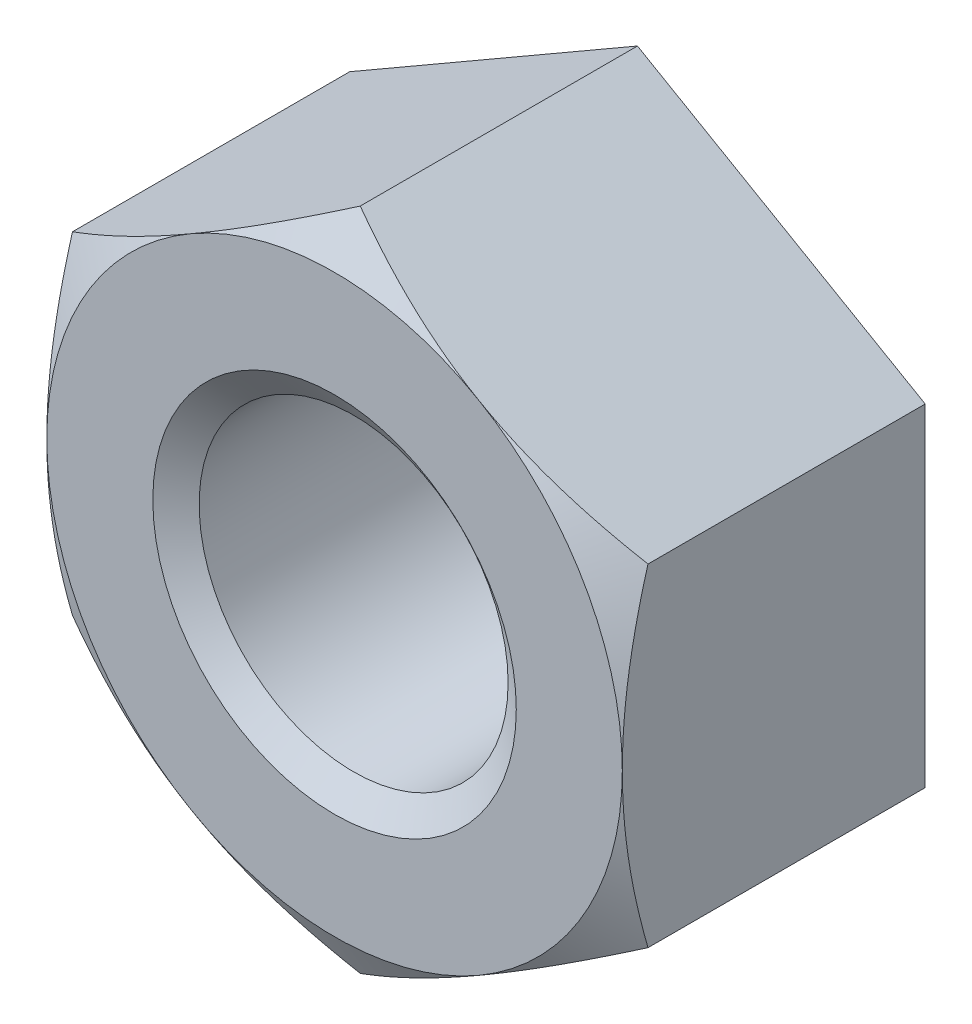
ISO-10303-21;
HEADER;
FILE_DESCRIPTION(('STEP AP214'),'2;1');
FILE_NAME('part.step','',(''),(''),'','','');
FILE_SCHEMA(('AUTOMOTIVE_DESIGN { 1 0 10303 214 1 1 1 1 }'));
ENDSEC;
DATA;
#1=APPLICATION_CONTEXT('core data for automotive mechanical design processes');
#2=APPLICATION_PROTOCOL_DEFINITION('international standard','automotive_design',2000,#1);
#3=PRODUCT_CONTEXT('',#1,'mechanical');
#4=PRODUCT('Part','Part','',(#3));
#5=PRODUCT_RELATED_PRODUCT_CATEGORY('part','',(#4));
#6=PRODUCT_DEFINITION_FORMATION('','',#4);
#7=PRODUCT_DEFINITION_CONTEXT('part definition',#1,'design');
#8=PRODUCT_DEFINITION('design','',#6,#7);
#9=PRODUCT_DEFINITION_SHAPE('','',#8);
#10=(LENGTH_UNIT() NAMED_UNIT(*) SI_UNIT(.MILLI.,.METRE.));
#11=(NAMED_UNIT(*) PLANE_ANGLE_UNIT() SI_UNIT($,.RADIAN.));
#12=(NAMED_UNIT(*) SI_UNIT($,.STERADIAN.) SOLID_ANGLE_UNIT());
#13=UNCERTAINTY_MEASURE_WITH_UNIT(LENGTH_MEASURE(1.E-05),#10,'distance_accuracy_value','');
#14=(GEOMETRIC_REPRESENTATION_CONTEXT(3) GLOBAL_UNCERTAINTY_ASSIGNED_CONTEXT((#13)) GLOBAL_UNIT_ASSIGNED_CONTEXT((#10,
#11,#12)) REPRESENTATION_CONTEXT('',''));
#15=CARTESIAN_POINT('',(0.,0.,0.));
#16=DIRECTION('',(0.,0.,1.));
#17=DIRECTION('',(1.,0.,0.));
#18=AXIS2_PLACEMENT_3D('',#15,#16,#17);
#19=CARTESIAN_POINT('',(0.,0.,-10.));
#20=DIRECTION('',(0.,0.,1.));
#21=DIRECTION('',(1.,0.,0.));
#22=AXIS2_PLACEMENT_3D('',#19,#20,#21);
#23=CYLINDRICAL_SURFACE('',#22,5.1);
#24=CARTESIAN_POINT('',(0.,0.,-0.630186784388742));
#25=DIRECTION('',(0.,0.,1.));
#26=DIRECTION('',(1.,0.,0.));
#27=AXIS2_PLACEMENT_3D('',#24,#25,#26);
#28=CIRCLE('',#27,5.1);
#29=CARTESIAN_POINT('',(5.1,0.,-0.630186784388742));
#30=VERTEX_POINT('',#29);
#31=EDGE_CURVE('E227',#30,#30,#28,.F.);
#32=ORIENTED_EDGE('',*,*,#31,.F.);
#33=EDGE_LOOP('',(#32));
#34=FACE_BOUND('',#33,.T.);
#35=CARTESIAN_POINT('',(0.,0.,-9.34441321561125));
#36=DIRECTION('',(0.,0.,-1.));
#37=DIRECTION('',(-1.,0.,0.));
#38=AXIS2_PLACEMENT_3D('',#35,#36,#37);
#39=CIRCLE('',#38,5.1);
#40=CARTESIAN_POINT('',(-5.1,0.,-9.34441321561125));
#41=VERTEX_POINT('',#40);
#42=EDGE_CURVE('E43',#41,#41,#39,.F.);
#43=ORIENTED_EDGE('',*,*,#42,.F.);
#44=EDGE_LOOP('',(#43));
#45=FACE_BOUND('',#44,.T.);
#46=ADVANCED_FACE('F38',(#34,#45),#23,.F.);
#47=CARTESIAN_POINT('',(0.,10.9696551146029,-10.));
#48=DIRECTION('',(0.,0.,-1.));
#49=DIRECTION('',(-1.,0.,0.));
#50=AXIS2_PLACEMENT_3D('',#47,#48,#49);
#51=PLANE('',#50);
#52=DIRECTION('',(-0.866025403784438,-0.500000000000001,0.));
#53=VECTOR('',#52,1.);
#54=CARTESIAN_POINT('',(0.,10.9696551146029,-10.));
#55=LINE('',#54,#53);
#56=CARTESIAN_POINT('',(0.,10.9696551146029,-10.));
#57=VERTEX_POINT('',#56);
#58=CARTESIAN_POINT('',(-9.5,5.48482755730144,-10.));
#59=VERTEX_POINT('',#58);
#60=EDGE_CURVE('E194',#57,#59,#55,.T.);
#61=ORIENTED_EDGE('',*,*,#60,.F.);
#62=DIRECTION('',(-0.866025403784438,0.500000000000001,0.));
#63=VECTOR('',#62,1.);
#64=CARTESIAN_POINT('',(9.5,5.48482755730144,-10.));
#65=LINE('',#64,#63);
#66=CARTESIAN_POINT('',(9.5,5.48482755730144,-10.));
#67=VERTEX_POINT('',#66);
#68=EDGE_CURVE('E244',#67,#57,#65,.T.);
#69=ORIENTED_EDGE('',*,*,#68,.F.);
#70=DIRECTION('',(0.,-1.,0.));
#71=VECTOR('',#70,1.);
#72=CARTESIAN_POINT('',(9.5,5.48482755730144,-10.));
#73=LINE('',#72,#71);
#74=CARTESIAN_POINT('',(9.5,-5.48482755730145,-10.));
#75=VERTEX_POINT('',#74);
#76=EDGE_CURVE('E258',#67,#75,#73,.T.);
#77=ORIENTED_EDGE('',*,*,#76,.T.);
#78=DIRECTION('',(0.866025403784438,0.500000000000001,0.));
#79=VECTOR('',#78,1.);
#80=CARTESIAN_POINT('',(0.,-10.9696551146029,-10.));
#81=LINE('',#80,#79);
#82=CARTESIAN_POINT('',(0.,-10.9696551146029,-10.));
#83=VERTEX_POINT('',#82);
#84=EDGE_CURVE('E260',#83,#75,#81,.T.);
#85=ORIENTED_EDGE('',*,*,#84,.F.);
#86=DIRECTION('',(0.866025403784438,-0.500000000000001,0.));
#87=VECTOR('',#86,1.);
#88=CARTESIAN_POINT('',(-9.5,-5.48482755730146,-10.));
#89=LINE('',#88,#87);
#90=CARTESIAN_POINT('',(-9.5,-5.48482755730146,-10.));
#91=VERTEX_POINT('',#90);
#92=EDGE_CURVE('E263',#91,#83,#89,.T.);
#93=ORIENTED_EDGE('',*,*,#92,.F.);
#94=DIRECTION('',(0.,-1.,0.));
#95=VECTOR('',#94,1.);
#96=CARTESIAN_POINT('',(-9.5,5.48482755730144,-10.));
#97=LINE('',#96,#95);
#98=EDGE_CURVE('E265',#59,#91,#97,.T.);
#99=ORIENTED_EDGE('',*,*,#98,.F.);
#100=EDGE_LOOP('',(#61,#69,#77,#85,#93,#99));
#101=FACE_BOUND('',#100,.T.);
#102=CARTESIAN_POINT('',(0.,0.,-10.));
#103=DIRECTION('',(0.,0.,-1.));
#104=DIRECTION('',(-1.,0.,0.));
#105=AXIS2_PLACEMENT_3D('',#102,#103,#104);
#106=CIRCLE('',#105,6.);
#107=CARTESIAN_POINT('',(-6.,0.,-10.));
#108=VERTEX_POINT('',#107);
#109=EDGE_CURVE('E232',#108,#108,#106,.F.);
#110=ORIENTED_EDGE('',*,*,#109,.T.);
#111=EDGE_LOOP('',(#110));
#112=FACE_BOUND('',#111,.T.);
#113=ADVANCED_FACE('F218',(#101,#112),#51,.T.);
#114=CARTESIAN_POINT('',(0.,10.9696551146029,0.));
#115=DIRECTION('',(0.,0.,-1.));
#116=DIRECTION('',(-1.,0.,0.));
#117=AXIS2_PLACEMENT_3D('',#114,#115,#116);
#118=PLANE('',#117);
#119=CARTESIAN_POINT('',(0.,0.,0.));
#120=DIRECTION('',(0.,0.,-1.));
#121=DIRECTION('',(-1.,0.,0.));
#122=AXIS2_PLACEMENT_3D('',#119,#120,#121);
#123=CIRCLE('',#122,9.5);
#124=CARTESIAN_POINT('',(-9.5,0.,0.));
#125=VERTEX_POINT('',#124);
#126=CARTESIAN_POINT('',(-4.75000000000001,8.22724133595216,0.));
#127=VERTEX_POINT('',#126);
#128=EDGE_CURVE('E11',#125,#127,#123,.T.);
#129=ORIENTED_EDGE('',*,*,#128,.F.);
#130=CARTESIAN_POINT('',(-4.75000000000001,-8.22724133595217,0.));
#131=VERTEX_POINT('',#130);
#132=EDGE_CURVE('E50',#131,#125,#123,.T.);
#133=ORIENTED_EDGE('',*,*,#132,.F.);
#134=CARTESIAN_POINT('',(4.75000000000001,-8.22724133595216,0.));
#135=VERTEX_POINT('',#134);
#136=EDGE_CURVE('E134',#135,#131,#123,.T.);
#137=ORIENTED_EDGE('',*,*,#136,.F.);
#138=CARTESIAN_POINT('',(9.5,0.,0.));
#139=VERTEX_POINT('',#138);
#140=EDGE_CURVE('E271',#139,#135,#123,.T.);
#141=ORIENTED_EDGE('',*,*,#140,.F.);
#142=CARTESIAN_POINT('',(0.,0.,0.));
#143=DIRECTION('',(0.,0.,1.));
#144=DIRECTION('',(1.,0.,0.));
#145=AXIS2_PLACEMENT_3D('',#142,#143,#144);
#146=CIRCLE('',#145,9.5);
#147=CARTESIAN_POINT('',(4.75000000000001,8.22724133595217,0.));
#148=VERTEX_POINT('',#147);
#149=EDGE_CURVE('E123',#139,#148,#146,.T.);
#150=ORIENTED_EDGE('',*,*,#149,.T.);
#151=EDGE_CURVE('E48',#127,#148,#123,.T.);
#152=ORIENTED_EDGE('',*,*,#151,.F.);
#153=EDGE_LOOP('',(#129,#133,#137,#141,#150,#152));
#154=FACE_BOUND('',#153,.T.);
#155=CARTESIAN_POINT('',(0.,0.,0.));
#156=DIRECTION('',(0.,0.,1.));
#157=DIRECTION('',(1.,0.,0.));
#158=AXIS2_PLACEMENT_3D('',#155,#156,#157);
#159=CIRCLE('',#158,6.);
#160=CARTESIAN_POINT('',(6.,0.,0.));
#161=VERTEX_POINT('',#160);
#162=EDGE_CURVE('E231',#161,#161,#159,.T.);
#163=ORIENTED_EDGE('',*,*,#162,.F.);
#164=EDGE_LOOP('',(#163));
#165=FACE_BOUND('',#164,.T.);
#166=ADVANCED_FACE('F136',(#154,#165),#118,.F.);
#167=CARTESIAN_POINT('',(0.,10.9696551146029,-10.));
#168=DIRECTION('',(-0.500000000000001,0.866025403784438,0.));
#169=DIRECTION('',(-0.866025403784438,-0.500000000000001,0.));
#170=AXIS2_PLACEMENT_3D('',#167,#168,#169);
#171=PLANE('',#170);
#172=DIRECTION('',(0.,0.,1.));
#173=VECTOR('',#172,1.);
#174=CARTESIAN_POINT('',(-9.5,5.48482755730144,-10.));
#175=LINE('',#174,#173);
#176=CARTESIAN_POINT('',(-9.5,5.48482755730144,-0.848505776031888));
#177=VERTEX_POINT('',#176);
#178=EDGE_CURVE('E242',#59,#177,#175,.T.);
#179=ORIENTED_EDGE('',*,*,#178,.T.);
#180=CARTESIAN_POINT('',(-9.5002,5.4847120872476,-0.848572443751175));
#181=CARTESIAN_POINT('',(-9.2913692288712,5.60528058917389,-0.778973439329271));
#182=CARTESIAN_POINT('',(-9.08175982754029,5.72629863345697,-0.712533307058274));
#183=CARTESIAN_POINT('',(-8.66086011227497,5.96930519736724,-0.586847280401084));
#184=CARTESIAN_POINT('',(-8.44956926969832,6.09129402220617,-0.527603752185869));
#185=CARTESIAN_POINT('',(-7.81229220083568,6.45922610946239,-0.361814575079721));
#186=CARTESIAN_POINT('',(-7.38379023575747,6.70662183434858,-0.267514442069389));
#187=CARTESIAN_POINT('',(-6.74255666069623,7.07683821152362,-0.156938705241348));
#188=CARTESIAN_POINT('',(-6.53174078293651,7.19855281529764,-0.125439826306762));
#189=CARTESIAN_POINT('',(-6.10913296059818,7.44254555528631,-0.0726182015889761));
#190=CARTESIAN_POINT('',(-5.89734099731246,7.56482370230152,-0.0512956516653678));
#191=CARTESIAN_POINT('',(-5.47340378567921,7.80958396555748,-0.019373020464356));
#192=CARTESIAN_POINT('',(-5.26125925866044,7.93206566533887,-0.00876019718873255));
#193=CARTESIAN_POINT('',(-4.83677424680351,8.17714220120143,0.0015174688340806));
#194=CARTESIAN_POINT('',(-4.62443376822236,8.29973703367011,0.00118264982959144));
#195=CARTESIAN_POINT('',(-4.22745800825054,8.5289310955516,-0.00967336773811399));
#196=CARTESIAN_POINT('',(-4.04279470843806,8.63554650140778,-0.0188702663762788));
#197=CARTESIAN_POINT('',(-3.67389999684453,8.84852796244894,-0.045365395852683));
#198=CARTESIAN_POINT('',(-3.48966861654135,8.95489399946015,-0.0626641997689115));
#199=CARTESIAN_POINT('',(-2.937688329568,9.27357996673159,-0.126304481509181));
#200=CARTESIAN_POINT('',(-2.57091646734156,9.4853358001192,-0.184381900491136));
#201=CARTESIAN_POINT('',(-1.83348217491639,9.91109368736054,-0.329576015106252));
#202=CARTESIAN_POINT('',(-1.46291385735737,10.1250414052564,-0.417308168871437));
#203=CARTESIAN_POINT('',(-0.727303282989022,10.5497463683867,-0.616423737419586));
#204=CARTESIAN_POINT('',(-0.362251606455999,10.7605090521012,-0.727760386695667));
#205=CARTESIAN_POINT('',(0.000199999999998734,10.9697705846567,-0.848572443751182));
#206=B_SPLINE_CURVE_WITH_KNOTS('',3,(#180,#181,#182,#183,#184,#185,#186,#187,#188,#189,#190,
#191,#192,#193,#194,#195,#196,#197,#198,#199,#200,#201,#202,#203,#204,#205),.UNSPECIFIED.,.F.,
.F.,(4,2,2,2,2,2,2,2,2,2,2,2,4),(0.,0.752880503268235,1.50600787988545,3.0154687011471,
3.75167336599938,4.48789219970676,5.22323407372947,5.95855322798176,6.59868084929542,
7.23885375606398,8.52010929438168,9.82978009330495,11.1368800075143),.UNSPECIFIED.);
#207=EDGE_CURVE('E118',#177,#127,#206,.T.);
#208=ORIENTED_EDGE('',*,*,#207,.T.);
#209=CARTESIAN_POINT('',(0.,10.9696551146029,-0.848505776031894));
#210=VERTEX_POINT('',#209);
#211=EDGE_CURVE('E57',#127,#210,#206,.T.);
#212=ORIENTED_EDGE('',*,*,#211,.T.);
#213=DIRECTION('',(0.,0.,1.));
#214=VECTOR('',#213,1.);
#215=CARTESIAN_POINT('',(0.,10.9696551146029,-10.));
#216=LINE('',#215,#214);
#217=EDGE_CURVE('E135',#57,#210,#216,.T.);
#218=ORIENTED_EDGE('',*,*,#217,.F.);
#219=ORIENTED_EDGE('',*,*,#60,.T.);
#220=EDGE_LOOP('',(#179,#208,#212,#218,#219));
#221=FACE_BOUND('',#220,.T.);
#222=ADVANCED_FACE('F40',(#221),#171,.T.);
#223=CARTESIAN_POINT('',(9.5,5.48482755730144,-10.));
#224=DIRECTION('',(0.500000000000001,0.866025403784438,0.));
#225=DIRECTION('',(-0.866025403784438,0.500000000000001,0.));
#226=AXIS2_PLACEMENT_3D('',#223,#224,#225);
#227=PLANE('',#226);
#228=ORIENTED_EDGE('',*,*,#217,.T.);
#229=CARTESIAN_POINT('',(-0.000200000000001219,10.9697705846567,-0.848572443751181));
#230=CARTESIAN_POINT('',(0.208630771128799,10.8492020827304,-0.778973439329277));
#231=CARTESIAN_POINT('',(0.418240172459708,10.7281840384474,-0.712533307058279));
#232=CARTESIAN_POINT('',(0.839139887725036,10.4851774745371,-0.586847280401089));
#233=CARTESIAN_POINT('',(1.05043073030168,10.3631886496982,-0.527603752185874));
#234=CARTESIAN_POINT('',(1.68770779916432,9.99525656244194,-0.361814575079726));
#235=CARTESIAN_POINT('',(2.11620976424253,9.74786083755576,-0.267514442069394));
#236=CARTESIAN_POINT('',(2.75744333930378,9.37764446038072,-0.156938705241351));
#237=CARTESIAN_POINT('',(2.96825921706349,9.2559298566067,-0.125439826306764));
#238=CARTESIAN_POINT('',(3.39086703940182,9.01193711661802,-0.0726182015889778));
#239=CARTESIAN_POINT('',(3.60265900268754,8.88965896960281,-0.0512956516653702));
#240=CARTESIAN_POINT('',(4.0265962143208,8.64489870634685,-0.0193730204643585));
#241=CARTESIAN_POINT('',(4.23874074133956,8.52241700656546,-0.0087601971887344));
#242=CARTESIAN_POINT('',(4.66322575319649,8.2773404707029,0.00151746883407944));
#243=CARTESIAN_POINT('',(4.87556623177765,8.15474563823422,0.00118264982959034));
#244=CARTESIAN_POINT('',(5.27254199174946,7.92555157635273,-0.00967336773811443));
#245=CARTESIAN_POINT('',(5.45720529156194,7.81893617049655,-0.0188702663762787));
#246=CARTESIAN_POINT('',(5.82610000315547,7.6059547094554,-0.0453653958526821));
#247=CARTESIAN_POINT('',(6.01033138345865,7.49958867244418,-0.0626641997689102));
#248=CARTESIAN_POINT('',(6.56231167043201,7.18090270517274,-0.126304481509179));
#249=CARTESIAN_POINT('',(6.92908353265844,6.96914687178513,-0.184381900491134));
#250=CARTESIAN_POINT('',(7.66651782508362,6.5433889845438,-0.329576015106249));
#251=CARTESIAN_POINT('',(8.03708614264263,6.32944126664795,-0.417308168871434));
#252=CARTESIAN_POINT('',(8.77269671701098,5.90473630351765,-0.616423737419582));
#253=CARTESIAN_POINT('',(9.137748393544,5.69397361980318,-0.727760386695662));
#254=CARTESIAN_POINT('',(9.5002,5.4847120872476,-0.848572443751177));
#255=B_SPLINE_CURVE_WITH_KNOTS('',3,(#229,#230,#231,#232,#233,#234,#235,#236,#237,#238,#239,
#240,#241,#242,#243,#244,#245,#246,#247,#248,#249,#250,#251,#252,#253,#254),.UNSPECIFIED.,.F.,
.F.,(4,2,2,2,2,2,2,2,2,2,2,2,4),(0.,0.752880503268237,1.50600787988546,3.01546870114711,
3.75167336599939,4.48789219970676,5.22323407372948,5.95855322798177,6.59868084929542,
7.23885375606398,8.52010929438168,9.82978009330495,11.1368800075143),.UNSPECIFIED.);
#256=EDGE_CURVE('E193',#210,#148,#255,.T.);
#257=ORIENTED_EDGE('',*,*,#256,.T.);
#258=CARTESIAN_POINT('',(9.5,5.48482755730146,-0.848505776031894));
#259=VERTEX_POINT('',#258);
#260=EDGE_CURVE('E64',#148,#259,#255,.T.);
#261=ORIENTED_EDGE('',*,*,#260,.T.);
#262=DIRECTION('',(0.,0.,1.));
#263=VECTOR('',#262,1.);
#264=CARTESIAN_POINT('',(9.5,5.48482755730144,-10.));
#265=LINE('',#264,#263);
#266=EDGE_CURVE('E251',#67,#259,#265,.T.);
#267=ORIENTED_EDGE('',*,*,#266,.F.);
#268=ORIENTED_EDGE('',*,*,#68,.T.);
#269=EDGE_LOOP('',(#228,#257,#261,#267,#268));
#270=FACE_BOUND('',#269,.T.);
#271=ADVANCED_FACE('F196',(#270),#227,.T.);
#272=CARTESIAN_POINT('',(9.5,5.48482755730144,-10.));
#273=DIRECTION('',(-1.,0.,0.));
#274=DIRECTION('',(0.,0.,1.));
#275=AXIS2_PLACEMENT_3D('',#272,#273,#274);
#276=PLANE('',#275);
#277=CARTESIAN_POINT('',(9.5,-14.5465709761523,-4.54600370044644));
#278=CARTESIAN_POINT('',(9.5,-14.3380268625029,-4.44519656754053));
#279=CARTESIAN_POINT('',(9.5,-14.129230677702,-4.34491115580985));
#280=CARTESIAN_POINT('',(9.5,-13.7110809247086,-4.14550353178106));
#281=CARTESIAN_POINT('',(9.5,-13.5017273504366,-4.04638133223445));
#282=CARTESIAN_POINT('',(9.5,-12.8726893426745,-3.75091045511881));
#283=CARTESIAN_POINT('',(9.5,-12.4520954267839,-3.55649036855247));
#284=CARTESIAN_POINT('',(9.5,-11.6055942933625,-3.17293577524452));
#285=CARTESIAN_POINT('',(9.5,-11.1796704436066,-2.98383788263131));
#286=CARTESIAN_POINT('',(9.5,-10.3243227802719,-2.61376109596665));
#287=CARTESIAN_POINT('',(9.5,-9.89489915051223,-2.4327817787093));
#288=CARTESIAN_POINT('',(9.5,-9.02653674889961,-2.07895754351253));
#289=CARTESIAN_POINT('',(9.5,-8.58754588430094,-1.90623976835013));
#290=CARTESIAN_POINT('',(9.5,-7.70438743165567,-1.57433108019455));
#291=CARTESIAN_POINT('',(9.5,-7.26021927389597,-1.41514167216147));
#292=CARTESIAN_POINT('',(9.5,-6.36690631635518,-1.11456802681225));
#293=CARTESIAN_POINT('',(9.5,-5.9177743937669,-0.973145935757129));
#294=CARTESIAN_POINT('',(9.5,-5.01314169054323,-0.712697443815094));
#295=CARTESIAN_POINT('',(9.5,-4.55764297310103,-0.5936639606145));
#296=CARTESIAN_POINT('',(9.5,-3.6398894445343,-0.383780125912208));
#297=CARTESIAN_POINT('',(9.5,-3.17763286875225,-0.292937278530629));
#298=CARTESIAN_POINT('',(9.5,-2.48018032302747,-0.182364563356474));
#299=CARTESIAN_POINT('',(9.5,-2.24698958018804,-0.14978651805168));
#300=CARTESIAN_POINT('',(9.5,-1.77951479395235,-0.0938352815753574));
#301=CARTESIAN_POINT('',(9.5,-1.54523086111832,-0.0704611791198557));
#302=CARTESIAN_POINT('',(9.5,-1.07737258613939,-0.0335468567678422));
#303=CARTESIAN_POINT('',(9.5,-0.843803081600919,-0.0199455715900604));
#304=CARTESIAN_POINT('',(9.5,-0.376297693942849,-0.00264879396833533));
#305=CARTESIAN_POINT('',(9.5,-0.142361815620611,0.0010468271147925));
#306=CARTESIAN_POINT('',(9.5,0.325389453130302,-0.00155578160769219));
#307=CARTESIAN_POINT('',(9.5,0.559204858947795,-0.00785120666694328));
#308=CARTESIAN_POINT('',(9.5,1.02636653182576,-0.030279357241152));
#309=CARTESIAN_POINT('',(9.5,1.25971277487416,-0.0464125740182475));
#310=CARTESIAN_POINT('',(9.5,1.82527222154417,-0.0971001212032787));
#311=CARTESIAN_POINT('',(9.5,2.15705089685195,-0.136583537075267));
#312=CARTESIAN_POINT('',(9.5,2.81806585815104,-0.233246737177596));
#313=CARTESIAN_POINT('',(9.5,3.14730142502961,-0.290431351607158));
#314=CARTESIAN_POINT('',(9.5,3.80295855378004,-0.420468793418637));
#315=CARTESIAN_POINT('',(9.5,4.12937714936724,-0.4933364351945));
#316=CARTESIAN_POINT('',(9.5,4.77885595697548,-0.652516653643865));
#317=CARTESIAN_POINT('',(9.5,5.10191648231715,-0.738827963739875));
#318=CARTESIAN_POINT('',(9.5,5.75263605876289,-0.925086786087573));
#319=CARTESIAN_POINT('',(9.5,6.08021372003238,-1.02531669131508));
#320=CARTESIAN_POINT('',(9.5,6.73190653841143,-1.23567979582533));
#321=CARTESIAN_POINT('',(9.5,7.05602391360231,-1.34580616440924));
#322=CARTESIAN_POINT('',(9.5,7.69949559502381,-1.5736874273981));
#323=CARTESIAN_POINT('',(9.5,8.01886644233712,-1.69139589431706));
#324=CARTESIAN_POINT('',(9.5,8.65513026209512,-1.93372164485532));
#325=CARTESIAN_POINT('',(9.5,8.97202217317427,-2.05834172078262));
#326=CARTESIAN_POINT('',(9.5,9.28776285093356,-2.18573389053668));
#327=B_SPLINE_CURVE_WITH_KNOTS('',3,(#277,#278,#279,#280,#281,#282,#283,#284,#285,#286,#287,
#288,#289,#290,#291,#292,#293,#294,#295,#296,#297,#298,#299,#300,#301,#302,#303,#304,#305,#306,
#307,#308,#309,#310,#311,#312,#313,#314,#315,#316,#317,#318,#319,#320,#321,#322,#323,#324,#325,
#326),.UNSPECIFIED.,.F.,.F.,(4,2,2,2,2,2,2,2,2,2,2,2,2,2,2,2,2,2,2,2,2,2,2,2,4),(0.,
0.694890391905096,1.38978839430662,2.7798104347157,4.17778700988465,5.57569062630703,
6.99075616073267,8.40597890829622,9.81813342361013,11.2298404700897,12.6419229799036,
13.3481360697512,14.0542792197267,14.7559707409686,15.4576531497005,16.1591386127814,
16.8606591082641,17.8624602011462,18.8645349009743,19.8675603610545,20.8704913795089,
21.8980064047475,22.9248175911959,23.9458491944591,24.9672963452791),.UNSPECIFIED.);
#328=CARTESIAN_POINT('',(9.50000000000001,-5.48482755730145,-0.848505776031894));
#329=VERTEX_POINT('',#328);
#330=EDGE_CURVE('E178',#329,#139,#327,.T.);
#331=ORIENTED_EDGE('',*,*,#330,.F.);
#332=DIRECTION('',(0.,0.,1.));
#333=VECTOR('',#332,1.);
#334=CARTESIAN_POINT('',(9.5,-5.48482755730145,-10.));
#335=LINE('',#334,#333);
#336=EDGE_CURVE('E248',#75,#329,#335,.T.);
#337=ORIENTED_EDGE('',*,*,#336,.F.);
#338=ORIENTED_EDGE('',*,*,#76,.F.);
#339=ORIENTED_EDGE('',*,*,#266,.T.);
#340=EDGE_CURVE('E187',#139,#259,#327,.T.);
#341=ORIENTED_EDGE('',*,*,#340,.F.);
#342=EDGE_LOOP('',(#331,#337,#338,#339,#341));
#343=FACE_BOUND('',#342,.T.);
#344=ADVANCED_FACE('F200',(#343),#276,.F.);
#345=CARTESIAN_POINT('',(0.,-10.9696551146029,-10.));
#346=DIRECTION('',(0.500000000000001,-0.866025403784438,0.));
#347=DIRECTION('',(0.866025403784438,0.500000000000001,0.));
#348=AXIS2_PLACEMENT_3D('',#345,#346,#347);
#349=PLANE('',#348);
#350=ORIENTED_EDGE('',*,*,#336,.T.);
#351=CARTESIAN_POINT('',(9.5002,-5.48471208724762,-0.84857244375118));
#352=CARTESIAN_POINT('',(9.2913692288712,-5.60528058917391,-0.778973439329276));
#353=CARTESIAN_POINT('',(9.08175982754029,-5.72629863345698,-0.71253330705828));
#354=CARTESIAN_POINT('',(8.66086011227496,-5.96930519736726,-0.58684728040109));
#355=CARTESIAN_POINT('',(8.44956926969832,-6.09129402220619,-0.527603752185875));
#356=CARTESIAN_POINT('',(7.81229220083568,-6.45922610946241,-0.361814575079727));
#357=CARTESIAN_POINT('',(7.38379023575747,-6.70662183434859,-0.267514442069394));
#358=CARTESIAN_POINT('',(6.74255666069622,-7.07683821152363,-0.156938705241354));
#359=CARTESIAN_POINT('',(6.53174078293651,-7.19855281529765,-0.125439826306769));
#360=CARTESIAN_POINT('',(6.10913296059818,-7.44254555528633,-0.0726182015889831));
#361=CARTESIAN_POINT('',(5.89734099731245,-7.56482370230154,-0.0512956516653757));
#362=CARTESIAN_POINT('',(5.4734037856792,-7.8095839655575,-0.0193730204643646));
#363=CARTESIAN_POINT('',(5.26125925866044,-7.93206566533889,-0.00876019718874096));
#364=CARTESIAN_POINT('',(4.83677424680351,-8.17714220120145,0.00151746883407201));
#365=CARTESIAN_POINT('',(4.62443376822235,-8.29973703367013,0.00118264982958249));
#366=CARTESIAN_POINT('',(4.22745800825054,-8.52893109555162,-0.00967336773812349));
#367=CARTESIAN_POINT('',(4.04279470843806,-8.6355465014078,-0.0188702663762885));
#368=CARTESIAN_POINT('',(3.67389999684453,-8.84852796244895,-0.0453653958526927));
#369=CARTESIAN_POINT('',(3.48966861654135,-8.95489399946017,-0.0626641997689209));
#370=CARTESIAN_POINT('',(2.93768832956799,-9.2735799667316,-0.12630448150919));
#371=CARTESIAN_POINT('',(2.57091646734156,-9.48533580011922,-0.184381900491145));
#372=CARTESIAN_POINT('',(1.83348217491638,-9.91109368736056,-0.329576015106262));
#373=CARTESIAN_POINT('',(1.46291385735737,-10.1250414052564,-0.417308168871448));
#374=CARTESIAN_POINT('',(0.72730328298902,-10.5497463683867,-0.616423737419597));
#375=CARTESIAN_POINT('',(0.362251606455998,-10.7605090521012,-0.727760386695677));
#376=CARTESIAN_POINT('',(-0.000199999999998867,-10.9697705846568,-0.848572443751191));
#377=B_SPLINE_CURVE_WITH_KNOTS('',3,(#351,#352,#353,#354,#355,#356,#357,#358,#359,#360,#361,
#362,#363,#364,#365,#366,#367,#368,#369,#370,#371,#372,#373,#374,#375,#376),.UNSPECIFIED.,.F.,
.F.,(4,2,2,2,2,2,2,2,2,2,2,2,4),(0.,0.752880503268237,1.50600787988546,3.01546870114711,
3.75167336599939,4.48789219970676,5.22323407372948,5.95855322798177,6.59868084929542,
7.23885375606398,8.52010929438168,9.82978009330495,11.1368800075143),.UNSPECIFIED.);
#378=EDGE_CURVE('E277',#329,#135,#377,.T.);
#379=ORIENTED_EDGE('',*,*,#378,.T.);
#380=CARTESIAN_POINT('',(0.,-10.9696551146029,-0.848505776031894));
#381=VERTEX_POINT('',#380);
#382=EDGE_CURVE('E172',#135,#381,#377,.T.);
#383=ORIENTED_EDGE('',*,*,#382,.T.);
#384=DIRECTION('',(0.,0.,1.));
#385=VECTOR('',#384,1.);
#386=CARTESIAN_POINT('',(0.,-10.9696551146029,-10.));
#387=LINE('',#386,#385);
#388=EDGE_CURVE('E246',#83,#381,#387,.T.);
#389=ORIENTED_EDGE('',*,*,#388,.F.);
#390=ORIENTED_EDGE('',*,*,#84,.T.);
#391=EDGE_LOOP('',(#350,#379,#383,#389,#390));
#392=FACE_BOUND('',#391,.T.);
#393=ADVANCED_FACE('F204',(#392),#349,.T.);
#394=CARTESIAN_POINT('',(-9.5,-5.48482755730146,-10.));
#395=DIRECTION('',(-0.500000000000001,-0.866025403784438,0.));
#396=DIRECTION('',(0.866025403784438,-0.500000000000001,0.));
#397=AXIS2_PLACEMENT_3D('',#394,#395,#396);
#398=PLANE('',#397);
#399=ORIENTED_EDGE('',*,*,#388,.T.);
#400=CARTESIAN_POINT('',(0.000200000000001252,-10.9697705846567,-0.84857244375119));
#401=CARTESIAN_POINT('',(-0.2086307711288,-10.8492020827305,-0.778973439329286));
#402=CARTESIAN_POINT('',(-0.41824017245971,-10.7281840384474,-0.712533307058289));
#403=CARTESIAN_POINT('',(-0.839139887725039,-10.4851774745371,-0.586847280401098));
#404=CARTESIAN_POINT('',(-1.05043073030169,-10.3631886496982,-0.527603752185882));
#405=CARTESIAN_POINT('',(-1.68770779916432,-9.99525656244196,-0.361814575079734));
#406=CARTESIAN_POINT('',(-2.11620976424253,-9.74786083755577,-0.267514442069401));
#407=CARTESIAN_POINT('',(-2.75744333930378,-9.37764446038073,-0.156938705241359));
#408=CARTESIAN_POINT('',(-2.9682592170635,-9.25592985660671,-0.125439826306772));
#409=CARTESIAN_POINT('',(-3.39086703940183,-9.01193711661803,-0.0726182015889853));
#410=CARTESIAN_POINT('',(-3.60265900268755,-8.88965896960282,-0.0512956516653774));
#411=CARTESIAN_POINT('',(-4.0265962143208,-8.64489870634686,-0.0193730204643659));
#412=CARTESIAN_POINT('',(-4.23874074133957,-8.52241700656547,-0.00876019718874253));
#413=CARTESIAN_POINT('',(-4.6632257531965,-8.27734047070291,0.00151746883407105));
#414=CARTESIAN_POINT('',(-4.87556623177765,-8.15474563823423,0.00118264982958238));
#415=CARTESIAN_POINT('',(-5.27254199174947,-7.92555157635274,-0.00967336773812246));
#416=CARTESIAN_POINT('',(-5.45720529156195,-7.81893617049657,-0.0188702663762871));
#417=CARTESIAN_POINT('',(-5.82610000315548,-7.60595470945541,-0.0453653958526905));
#418=CARTESIAN_POINT('',(-6.01033138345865,-7.4995886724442,-0.0626641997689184));
#419=CARTESIAN_POINT('',(-6.56231167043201,-7.18090270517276,-0.126304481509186));
#420=CARTESIAN_POINT('',(-6.92908353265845,-6.96914687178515,-0.184381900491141));
#421=CARTESIAN_POINT('',(-7.66651782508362,-6.54338898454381,-0.329576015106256));
#422=CARTESIAN_POINT('',(-8.03708614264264,-6.32944126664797,-0.417308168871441));
#423=CARTESIAN_POINT('',(-8.77269671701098,-5.90473630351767,-0.616423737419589));
#424=CARTESIAN_POINT('',(-9.137748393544,-5.6939736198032,-0.727760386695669));
#425=CARTESIAN_POINT('',(-9.5002,-5.48471208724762,-0.848572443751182));
#426=B_SPLINE_CURVE_WITH_KNOTS('',3,(#400,#401,#402,#403,#404,#405,#406,#407,#408,#409,#410,
#411,#412,#413,#414,#415,#416,#417,#418,#419,#420,#421,#422,#423,#424,#425),.UNSPECIFIED.,.F.,
.F.,(4,2,2,2,2,2,2,2,2,2,2,2,4),(0.,0.752880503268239,1.50600787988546,3.01546870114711,
3.75167336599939,4.48789219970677,5.22323407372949,5.95855322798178,6.59868084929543,
7.23885375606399,8.52010929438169,9.82978009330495,11.1368800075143),.UNSPECIFIED.);
#427=EDGE_CURVE('E143',#381,#131,#426,.T.);
#428=ORIENTED_EDGE('',*,*,#427,.T.);
#429=CARTESIAN_POINT('',(-9.5,-5.48482755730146,-0.848505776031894));
#430=VERTEX_POINT('',#429);
#431=EDGE_CURVE('E130',#131,#430,#426,.T.);
#432=ORIENTED_EDGE('',*,*,#431,.T.);
#433=DIRECTION('',(0.,0.,1.));
#434=VECTOR('',#433,1.);
#435=CARTESIAN_POINT('',(-9.5,-5.48482755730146,-10.));
#436=LINE('',#435,#434);
#437=EDGE_CURVE('E142',#91,#430,#436,.T.);
#438=ORIENTED_EDGE('',*,*,#437,.F.);
#439=ORIENTED_EDGE('',*,*,#92,.T.);
#440=EDGE_LOOP('',(#399,#428,#432,#438,#439));
#441=FACE_BOUND('',#440,.T.);
#442=ADVANCED_FACE('F208',(#441),#398,.T.);
#443=CARTESIAN_POINT('',(-9.5,5.48482755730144,-10.));
#444=DIRECTION('',(-1.,0.,0.));
#445=DIRECTION('',(0.,0.,1.));
#446=AXIS2_PLACEMENT_3D('',#443,#444,#445);
#447=PLANE('',#446);
#448=ORIENTED_EDGE('',*,*,#437,.T.);
#449=CARTESIAN_POINT('',(-9.5,-14.5465709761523,-4.54600370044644));
#450=CARTESIAN_POINT('',(-9.5,-14.3380268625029,-4.44519656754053));
#451=CARTESIAN_POINT('',(-9.5,-14.129230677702,-4.34491115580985));
#452=CARTESIAN_POINT('',(-9.5,-13.7110809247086,-4.14550353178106));
#453=CARTESIAN_POINT('',(-9.5,-13.5017273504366,-4.04638133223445));
#454=CARTESIAN_POINT('',(-9.5,-12.8726893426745,-3.75091045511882));
#455=CARTESIAN_POINT('',(-9.5,-12.4520954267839,-3.55649036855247));
#456=CARTESIAN_POINT('',(-9.5,-11.6055942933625,-3.17293577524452));
#457=CARTESIAN_POINT('',(-9.5,-11.1796704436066,-2.98383788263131));
#458=CARTESIAN_POINT('',(-9.5,-10.3243227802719,-2.61376109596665));
#459=CARTESIAN_POINT('',(-9.5,-9.89489915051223,-2.4327817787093));
#460=CARTESIAN_POINT('',(-9.5,-9.02653674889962,-2.07895754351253));
#461=CARTESIAN_POINT('',(-9.5,-8.58754588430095,-1.90623976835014));
#462=CARTESIAN_POINT('',(-9.5,-7.70438743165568,-1.57433108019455));
#463=CARTESIAN_POINT('',(-9.5,-7.26021927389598,-1.41514167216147));
#464=CARTESIAN_POINT('',(-9.5,-6.36690631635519,-1.11456802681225));
#465=CARTESIAN_POINT('',(-9.5,-5.9177743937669,-0.973145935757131));
#466=CARTESIAN_POINT('',(-9.5,-5.01314169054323,-0.712697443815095));
#467=CARTESIAN_POINT('',(-9.5,-4.55764297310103,-0.593663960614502));
#468=CARTESIAN_POINT('',(-9.5,-3.63988944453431,-0.383780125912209));
#469=CARTESIAN_POINT('',(-9.5,-3.17763286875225,-0.292937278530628));
#470=CARTESIAN_POINT('',(-9.5,-2.48018032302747,-0.182364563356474));
#471=CARTESIAN_POINT('',(-9.5,-2.24698958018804,-0.149786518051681));
#472=CARTESIAN_POINT('',(-9.5,-1.77951479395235,-0.0938352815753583));
#473=CARTESIAN_POINT('',(-9.5,-1.54523086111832,-0.070461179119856));
#474=CARTESIAN_POINT('',(-9.5,-1.07737258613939,-0.0335468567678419));
#475=CARTESIAN_POINT('',(-9.5,-0.843803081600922,-0.0199455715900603));
#476=CARTESIAN_POINT('',(-9.5,-0.376297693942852,-0.00264879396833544));
#477=CARTESIAN_POINT('',(-9.5,-0.142361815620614,0.00104682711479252));
#478=CARTESIAN_POINT('',(-9.5,0.325389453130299,-0.00155578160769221));
#479=CARTESIAN_POINT('',(-9.5,0.559204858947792,-0.00785120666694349));
#480=CARTESIAN_POINT('',(-9.5,1.02636653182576,-0.0302793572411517));
#481=CARTESIAN_POINT('',(-9.5,1.25971277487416,-0.0464125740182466));
#482=CARTESIAN_POINT('',(-9.5,1.82527222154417,-0.0971001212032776));
#483=CARTESIAN_POINT('',(-9.5,2.15705089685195,-0.136583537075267));
#484=CARTESIAN_POINT('',(-9.5,2.81806585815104,-0.233246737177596));
#485=CARTESIAN_POINT('',(-9.5,3.14730142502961,-0.290431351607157));
#486=CARTESIAN_POINT('',(-9.5,3.80295855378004,-0.420468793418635));
#487=CARTESIAN_POINT('',(-9.5,4.12937714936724,-0.4933364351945));
#488=CARTESIAN_POINT('',(-9.5,4.77885595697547,-0.652516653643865));
#489=CARTESIAN_POINT('',(-9.5,5.10191648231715,-0.738827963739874));
#490=CARTESIAN_POINT('',(-9.5,5.75263605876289,-0.925086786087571));
#491=CARTESIAN_POINT('',(-9.5,6.08021372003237,-1.02531669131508));
#492=CARTESIAN_POINT('',(-9.5,6.73190653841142,-1.23567979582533));
#493=CARTESIAN_POINT('',(-9.5,7.05602391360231,-1.34580616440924));
#494=CARTESIAN_POINT('',(-9.5,7.6994955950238,-1.5736874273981));
#495=CARTESIAN_POINT('',(-9.5,8.01886644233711,-1.69139589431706));
#496=CARTESIAN_POINT('',(-9.5,8.65513026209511,-1.93372164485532));
#497=CARTESIAN_POINT('',(-9.5,8.97202217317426,-2.05834172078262));
#498=CARTESIAN_POINT('',(-9.5,9.28776285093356,-2.18573389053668));
#499=B_SPLINE_CURVE_WITH_KNOTS('',3,(#449,#450,#451,#452,#453,#454,#455,#456,#457,#458,#459,
#460,#461,#462,#463,#464,#465,#466,#467,#468,#469,#470,#471,#472,#473,#474,#475,#476,#477,#478,
#479,#480,#481,#482,#483,#484,#485,#486,#487,#488,#489,#490,#491,#492,#493,#494,#495,#496,#497,
#498),.UNSPECIFIED.,.F.,.F.,(4,2,2,2,2,2,2,2,2,2,2,2,2,2,2,2,2,2,2,2,2,2,2,2,4),(0.,
0.694890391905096,1.38978839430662,2.7798104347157,4.17778700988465,5.57569062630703,
6.99075616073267,8.40597890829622,9.81813342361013,11.2298404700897,12.6419229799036,
13.3481360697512,14.0542792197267,14.7559707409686,15.4576531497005,16.1591386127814,
16.8606591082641,17.8624602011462,18.8645349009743,19.8675603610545,20.8704913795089,
21.8980064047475,22.9248175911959,23.9458491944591,24.9672963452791),.UNSPECIFIED.);
#500=EDGE_CURVE('E122',#430,#125,#499,.T.);
#501=ORIENTED_EDGE('',*,*,#500,.T.);
#502=EDGE_CURVE('E112',#125,#177,#499,.T.);
#503=ORIENTED_EDGE('',*,*,#502,.T.);
#504=ORIENTED_EDGE('',*,*,#178,.F.);
#505=ORIENTED_EDGE('',*,*,#98,.T.);
#506=EDGE_LOOP('',(#448,#501,#503,#504,#505));
#507=FACE_BOUND('',#506,.T.);
#508=ADVANCED_FACE('F140',(#507),#447,.T.);
#509=CARTESIAN_POINT('',(0.,0.,0.));
#510=DIRECTION('',(0.,0.,-1.));
#511=DIRECTION('',(-1.,0.,0.));
#512=AXIS2_PLACEMENT_3D('',#509,#510,#511);
#513=CONICAL_SURFACE('',#512,9.5,1.0471975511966);
#514=ORIENTED_EDGE('',*,*,#132,.T.);
#515=ORIENTED_EDGE('',*,*,#500,.F.);
#516=ORIENTED_EDGE('',*,*,#431,.F.);
#517=EDGE_LOOP('',(#514,#515,#516));
#518=FACE_BOUND('',#517,.T.);
#519=ADVANCED_FACE('F128',(#518),#513,.T.);
#520=ORIENTED_EDGE('',*,*,#136,.T.);
#521=ORIENTED_EDGE('',*,*,#427,.F.);
#522=ORIENTED_EDGE('',*,*,#382,.F.);
#523=EDGE_LOOP('',(#520,#521,#522));
#524=FACE_BOUND('',#523,.T.);
#525=ADVANCED_FACE('F161',(#524),#513,.T.);
#526=ORIENTED_EDGE('',*,*,#330,.T.);
#527=ORIENTED_EDGE('',*,*,#140,.T.);
#528=ORIENTED_EDGE('',*,*,#378,.F.);
#529=EDGE_LOOP('',(#526,#527,#528));
#530=FACE_BOUND('',#529,.T.);
#531=ADVANCED_FACE('F282',(#530),#513,.T.);
#532=ORIENTED_EDGE('',*,*,#149,.F.);
#533=ORIENTED_EDGE('',*,*,#340,.T.);
#534=ORIENTED_EDGE('',*,*,#260,.F.);
#535=EDGE_LOOP('',(#532,#533,#534));
#536=FACE_BOUND('',#535,.T.);
#537=ADVANCED_FACE('F275',(#536),#513,.T.);
#538=ORIENTED_EDGE('',*,*,#151,.T.);
#539=ORIENTED_EDGE('',*,*,#256,.F.);
#540=ORIENTED_EDGE('',*,*,#211,.F.);
#541=EDGE_LOOP('',(#538,#539,#540));
#542=FACE_BOUND('',#541,.T.);
#543=ADVANCED_FACE('F162',(#542),#513,.T.);
#544=ORIENTED_EDGE('',*,*,#502,.F.);
#545=ORIENTED_EDGE('',*,*,#128,.T.);
#546=ORIENTED_EDGE('',*,*,#207,.F.);
#547=EDGE_LOOP('',(#544,#545,#546));
#548=FACE_BOUND('',#547,.T.);
#549=ADVANCED_FACE('F114',(#548),#513,.T.);
#550=CARTESIAN_POINT('',(0.,0.,-0.693205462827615));
#551=DIRECTION('',(0.,0.,1.));
#552=DIRECTION('',(1.,0.,0.));
#553=AXIS2_PLACEMENT_3D('',#550,#551,#552);
#554=CONICAL_SURFACE('',#553,5.01,0.959931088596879);
#555=ORIENTED_EDGE('',*,*,#162,.T.);
#556=EDGE_LOOP('',(#555));
#557=FACE_BOUND('',#556,.T.);
#558=ORIENTED_EDGE('',*,*,#31,.T.);
#559=EDGE_LOOP('',(#558));
#560=FACE_BOUND('',#559,.T.);
#561=ADVANCED_FACE('F163',(#557,#560),#554,.F.);
#562=CARTESIAN_POINT('',(0.,0.,-9.9746));
#563=DIRECTION('',(0.,0.,-1.));
#564=DIRECTION('',(-1.,0.,0.));
#565=AXIS2_PLACEMENT_3D('',#562,#563,#564);
#566=CONICAL_SURFACE('',#565,6.,0.95993108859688);
#567=CARTESIAN_POINT('',(0.,0.,-9.9746));
#568=DIRECTION('',(0.,0.,1.));
#569=DIRECTION('',(1.,0.,0.));
#570=AXIS2_PLACEMENT_3D('',#567,#568,#569);
#571=CIRCLE('',#570,6.);
#572=CARTESIAN_POINT('',(6.,0.,-9.9746));
#573=VERTEX_POINT('',#572);
#574=EDGE_CURVE('E235',#573,#573,#571,.T.);
#575=ORIENTED_EDGE('',*,*,#574,.F.);
#576=EDGE_LOOP('',(#575));
#577=FACE_BOUND('',#576,.T.);
#578=ORIENTED_EDGE('',*,*,#42,.T.);
#579=EDGE_LOOP('',(#578));
#580=FACE_BOUND('',#579,.T.);
#581=ADVANCED_FACE('F298',(#577,#580),#566,.F.);
#582=CARTESIAN_POINT('',(0.,0.,-25.0375057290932));
#583=DIRECTION('',(0.,0.,1.));
#584=DIRECTION('',(1.,0.,0.));
#585=AXIS2_PLACEMENT_3D('',#582,#583,#584);
#586=CYLINDRICAL_SURFACE('',#585,6.);
#587=ORIENTED_EDGE('',*,*,#109,.F.);
#588=EDGE_LOOP('',(#587));
#589=FACE_BOUND('',#588,.T.);
#590=ORIENTED_EDGE('',*,*,#574,.T.);
#591=EDGE_LOOP('',(#590));
#592=FACE_BOUND('',#591,.T.);
#593=ADVANCED_FACE('F397',(#589,#592),#586,.F.);
#594=CLOSED_SHELL('',(#46,#113,#166,#222,#271,#344,#393,#442,#508,#519,#525,#531,#537,#543,#549,
#561,#581,#593));
#595=MANIFOLD_SOLID_BREP('B2',#594);
#596=ADVANCED_BREP_SHAPE_REPRESENTATION('',(#18,#595),#14);
#597=SHAPE_DEFINITION_REPRESENTATION(#9,#596);
ENDSEC;
END-ISO-10303-21;
